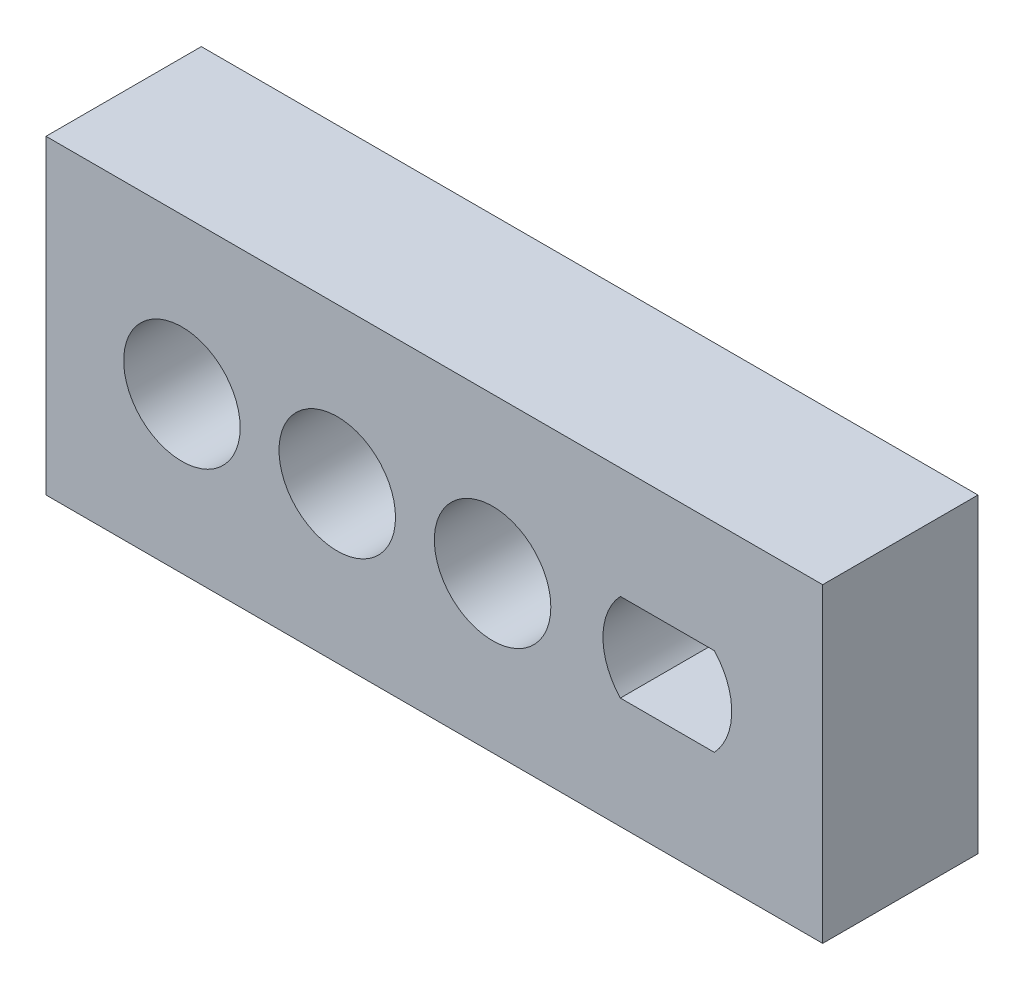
from build123d import *

# Parameters (mm, degrees)
SKETCH1_W      = 127
SKETCH1_H      = 50.8
SKETCH1_R      = 9.525
EXTRUDE1_DEPTH = 25.4


with BuildPart() as part:
    # Sketch1 → Extrude1 (new body)
    with BuildSketch(Plane.XY):
        with Locations((-46.640954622, 25.092355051)):
            Rectangle(SKETCH1_W, SKETCH1_H)
        with Locations((-37.115954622, 25.092355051)):
            Circle(SKETCH1_R, mode=Mode.SUBTRACT)
        with Locations((-62.515954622, 25.092355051)):
            Circle(SKETCH1_R, mode=Mode.SUBTRACT)
        with Locations((-87.915954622, 25.092355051)):
            Circle(SKETCH1_R, mode=Mode.SUBTRACT)
        with BuildLine():
            Line((-8.540954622, 32.290196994), (-0.857454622, 32.290196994))
            ThreePointArc((-0.857454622, 32.290196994), (1.987345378, 25.092355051), (-0.857454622, 17.894513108))
            Line((-0.857454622, 17.894513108), (-8.540954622, 17.894513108))
            Line((-8.540954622, 17.894513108), (-16.224454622, 17.894513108))
            ThreePointArc((-16.224454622, 17.894513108), (-19.069254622, 25.092355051), (-16.224454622, 32.290196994))
            Line((-16.224454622, 32.290196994), (-8.540954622, 32.290196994))
        make_face(mode=Mode.SUBTRACT)
    extrude(amount=EXTRUDE1_DEPTH)


solid = part.part
